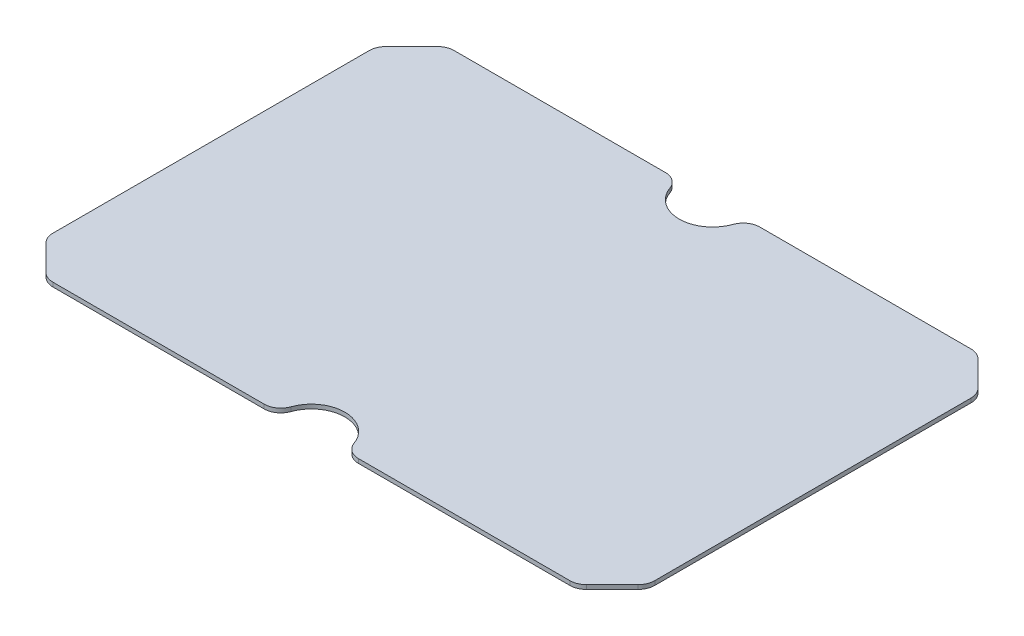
from build123d import *

# Parameters (mm, degrees)
SKETCH1_W           = 914.4
SKETCH1_H           = 609.6
BOSS_EXTRUDE1_DEPTH = 6.35
SKETCH2_R           = 50.8
CUT_EXTRUDE1_DEPTH  = 550.522704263
CHAMFER1_SIZE       = 53.975
FILLET1_R           = 25.4


with BuildPart() as part:
    # Sketch1 → Boss-Extrude1 (new body)
    with BuildSketch(Plane(origin=(0, 0, 0), x_dir=(1, 0, 0), z_dir=(0, 1, 0))):
        Rectangle(SKETCH1_W, SKETCH1_H)
    extrude(amount=BOSS_EXTRUDE1_DEPTH)

    # Sketch2 → Cut-Extrude1 (cut, through all)
    with BuildSketch(Plane(origin=(0, 6.35, 0), x_dir=(1, 0, 0), z_dir=(0, 1, 0))):
        with Locations((0, -304.8)):
            Circle(SKETCH2_R)
    cut_extrude1 = extrude(amount=-CUT_EXTRUDE1_DEPTH, mode=Mode.SUBTRACT)

    # Mirror1: Cut-Extrude1 across plane
    add(cut_extrude1.mirror(Plane.XY), mode=Mode.SUBTRACT)

    # Chamfer1
    chamfer1_edges = [part.edges().sort_by_distance(p)[0] for p in [
        (457.2, 3.175, 304.8),
        (-457.2, 3.175, 304.8),
        (-457.2, 3.175, -304.8),
        (457.2, 3.175, -304.8),
    ]]
    chamfer(chamfer1_edges, length=CHAMFER1_SIZE)

    # Fillet1
    fillet1_edges = [part.edges().sort_by_distance(p)[0] for p in [
        (-50.8, 3.175, 304.8),
        (50.8, 3.175, 304.8),
        (50.8, 3.175, -304.8),
        (-50.8, 3.175, -304.8),
        (457.2, 3.175, -250.825),
        (457.2, 3.175, 250.825),
        (403.225, 3.175, 304.8),
        (403.225, 3.175, -304.8),
        (-457.2, 3.175, 250.825),
        (-457.2, 3.175, -250.825),
        (-403.225, 3.175, -304.8),
        (-403.225, 3.175, 304.8),
    ]]
    fillet(fillet1_edges, radius=FILLET1_R)


solid = part.part
